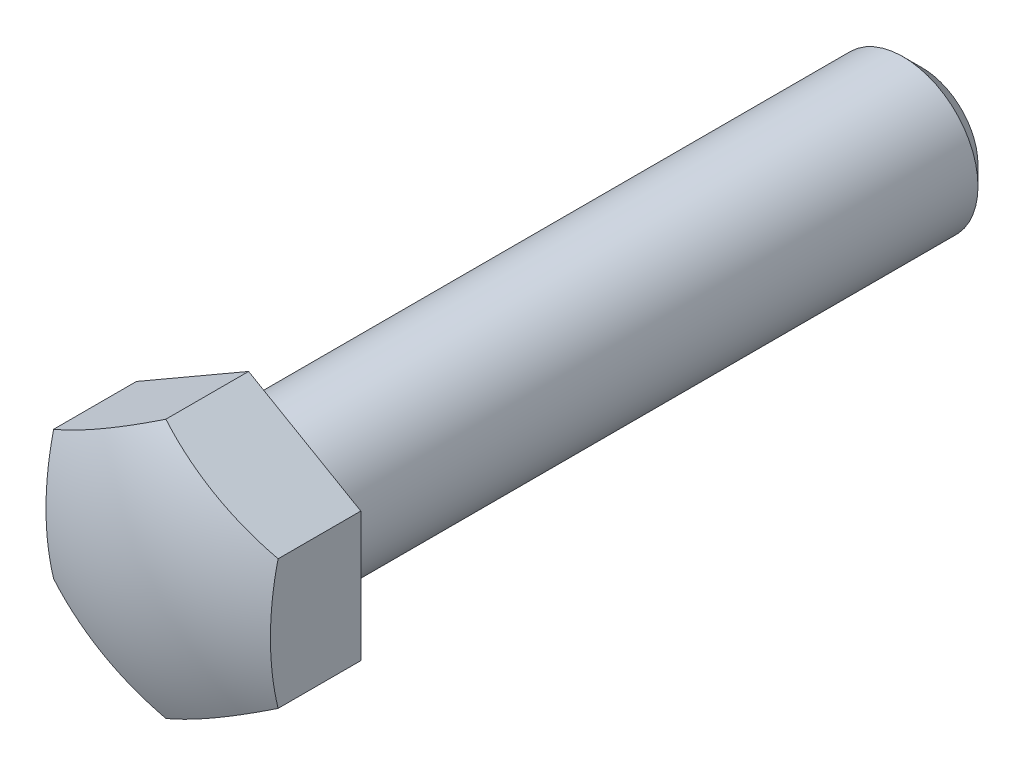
ISO-10303-21;
HEADER;
FILE_DESCRIPTION(('STEP AP214'),'2;1');
FILE_NAME('part.step','',(''),(''),'','','');
FILE_SCHEMA(('AUTOMOTIVE_DESIGN { 1 0 10303 214 1 1 1 1 }'));
ENDSEC;
DATA;
#1=APPLICATION_CONTEXT('core data for automotive mechanical design processes');
#2=APPLICATION_PROTOCOL_DEFINITION('international standard','automotive_design',2000,#1);
#3=PRODUCT_CONTEXT('',#1,'mechanical');
#4=PRODUCT('Part','Part','',(#3));
#5=PRODUCT_RELATED_PRODUCT_CATEGORY('part','',(#4));
#6=PRODUCT_DEFINITION_FORMATION('','',#4);
#7=PRODUCT_DEFINITION_CONTEXT('part definition',#1,'design');
#8=PRODUCT_DEFINITION('design','',#6,#7);
#9=PRODUCT_DEFINITION_SHAPE('','',#8);
#10=(LENGTH_UNIT() NAMED_UNIT(*) SI_UNIT(.MILLI.,.METRE.));
#11=(NAMED_UNIT(*) PLANE_ANGLE_UNIT() SI_UNIT($,.RADIAN.));
#12=(NAMED_UNIT(*) SI_UNIT($,.STERADIAN.) SOLID_ANGLE_UNIT());
#13=UNCERTAINTY_MEASURE_WITH_UNIT(LENGTH_MEASURE(1.E-05),#10,'distance_accuracy_value','');
#14=(GEOMETRIC_REPRESENTATION_CONTEXT(3) GLOBAL_UNCERTAINTY_ASSIGNED_CONTEXT((#13)) GLOBAL_UNIT_ASSIGNED_CONTEXT((#10,
#11,#12)) REPRESENTATION_CONTEXT('',''));
#15=CARTESIAN_POINT('',(0.,0.,0.));
#16=DIRECTION('',(0.,0.,1.));
#17=DIRECTION('',(1.,0.,0.));
#18=AXIS2_PLACEMENT_3D('',#15,#16,#17);
#19=CARTESIAN_POINT('',(10.,0.,0.));
#20=DIRECTION('',(0.,0.,1.));
#21=DIRECTION('',(1.,0.,0.));
#22=AXIS2_PLACEMENT_3D('',#19,#20,#21);
#23=PLANE('',#22);
#24=CARTESIAN_POINT('',(0.,0.,0.));
#25=DIRECTION('',(0.,0.,1.));
#26=DIRECTION('',(1.,0.,0.));
#27=AXIS2_PLACEMENT_3D('',#24,#25,#26);
#28=CIRCLE('',#27,10.);
#29=CARTESIAN_POINT('',(10.,0.,0.));
#30=VERTEX_POINT('',#29);
#31=EDGE_CURVE('E115',#30,#30,#28,.T.);
#32=ORIENTED_EDGE('',*,*,#31,.T.);
#33=EDGE_LOOP('',(#32));
#34=FACE_BOUND('',#33,.T.);
#35=DIRECTION('',(-0.86602540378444,-0.5,0.));
#36=VECTOR('',#35,1.);
#37=CARTESIAN_POINT('',(15.,-8.66025403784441,0.));
#38=LINE('',#37,#36);
#39=CARTESIAN_POINT('',(15.,-8.66025403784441,0.));
#40=VERTEX_POINT('',#39);
#41=CARTESIAN_POINT('',(0.,-17.3205080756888,0.));
#42=VERTEX_POINT('',#41);
#43=EDGE_CURVE('E89',#40,#42,#38,.T.);
#44=ORIENTED_EDGE('',*,*,#43,.T.);
#45=DIRECTION('',(0.86602540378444,-0.5,0.));
#46=VECTOR('',#45,1.);
#47=CARTESIAN_POINT('',(-15.,-8.66025403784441,0.));
#48=LINE('',#47,#46);
#49=CARTESIAN_POINT('',(-15.,-8.6602540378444,0.));
#50=VERTEX_POINT('',#49);
#51=EDGE_CURVE('E87',#50,#42,#48,.T.);
#52=ORIENTED_EDGE('',*,*,#51,.F.);
#53=DIRECTION('',(0.,-1.,0.));
#54=VECTOR('',#53,1.);
#55=CARTESIAN_POINT('',(-15.,8.66025403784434,0.));
#56=LINE('',#55,#54);
#57=CARTESIAN_POINT('',(-15.,8.66025403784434,0.));
#58=VERTEX_POINT('',#57);
#59=EDGE_CURVE('E37',#58,#50,#56,.T.);
#60=ORIENTED_EDGE('',*,*,#59,.F.);
#61=DIRECTION('',(0.866025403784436,0.5,0.));
#62=VECTOR('',#61,1.);
#63=CARTESIAN_POINT('',(-15.,8.66025403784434,0.));
#64=LINE('',#63,#62);
#65=CARTESIAN_POINT('',(0.,17.3205080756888,0.));
#66=VERTEX_POINT('',#65);
#67=EDGE_CURVE('E77',#58,#66,#64,.T.);
#68=ORIENTED_EDGE('',*,*,#67,.T.);
#69=DIRECTION('',(-0.866025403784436,0.5,0.));
#70=VECTOR('',#69,1.);
#71=CARTESIAN_POINT('',(15.,8.66025403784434,0.));
#72=LINE('',#71,#70);
#73=CARTESIAN_POINT('',(15.,8.66025403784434,0.));
#74=VERTEX_POINT('',#73);
#75=EDGE_CURVE('E83',#74,#66,#72,.T.);
#76=ORIENTED_EDGE('',*,*,#75,.F.);
#77=DIRECTION('',(0.,-1.,0.));
#78=VECTOR('',#77,1.);
#79=CARTESIAN_POINT('',(15.,8.66025403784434,0.));
#80=LINE('',#79,#78);
#81=EDGE_CURVE('E95',#74,#40,#80,.T.);
#82=ORIENTED_EDGE('',*,*,#81,.T.);
#83=EDGE_LOOP('',(#44,#52,#60,#68,#76,#82));
#84=FACE_BOUND('',#83,.T.);
#85=ADVANCED_FACE('F14',(#34,#84),#23,.F.);
#86=CARTESIAN_POINT('',(0.,0.,-30.));
#87=DIRECTION('',(0.,0.,1.));
#88=DIRECTION('',(1.,0.,0.));
#89=AXIS2_PLACEMENT_3D('',#86,#87,#88);
#90=CYLINDRICAL_SURFACE('',#89,10.);
#91=CARTESIAN_POINT('',(0.,0.,-87.5));
#92=DIRECTION('',(0.,0.,1.));
#93=DIRECTION('',(1.,0.,0.));
#94=AXIS2_PLACEMENT_3D('',#91,#92,#93);
#95=CIRCLE('',#94,10.);
#96=CARTESIAN_POINT('',(10.,0.,-87.5));
#97=VERTEX_POINT('',#96);
#98=EDGE_CURVE('E22',#97,#97,#95,.T.);
#99=ORIENTED_EDGE('',*,*,#98,.T.);
#100=EDGE_LOOP('',(#99));
#101=FACE_BOUND('',#100,.T.);
#102=ORIENTED_EDGE('',*,*,#31,.F.);
#103=EDGE_LOOP('',(#102));
#104=FACE_BOUND('',#103,.T.);
#105=ADVANCED_FACE('F120',(#101,#104),#90,.T.);
#106=CARTESIAN_POINT('',(0.,0.,-90.));
#107=DIRECTION('',(0.,0.,1.));
#108=DIRECTION('',(1.,0.,0.));
#109=AXIS2_PLACEMENT_3D('',#106,#107,#108);
#110=PLANE('',#109);
#111=CARTESIAN_POINT('',(0.,0.,-90.));
#112=DIRECTION('',(0.,0.,1.));
#113=DIRECTION('',(1.,0.,0.));
#114=AXIS2_PLACEMENT_3D('',#111,#112,#113);
#115=CIRCLE('',#114,7.5);
#116=CARTESIAN_POINT('',(7.5,0.,-90.));
#117=VERTEX_POINT('',#116);
#118=EDGE_CURVE('E9',#117,#117,#115,.F.);
#119=ORIENTED_EDGE('',*,*,#118,.T.);
#120=EDGE_LOOP('',(#119));
#121=FACE_BOUND('',#120,.T.);
#122=ADVANCED_FACE('F141',(#121),#110,.F.);
#123=CARTESIAN_POINT('',(15.,-8.66025403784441,15.));
#124=DIRECTION('',(0.5,-0.86602540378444,0.));
#125=DIRECTION('',(0.86602540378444,0.5,0.));
#126=AXIS2_PLACEMENT_3D('',#123,#124,#125);
#127=PLANE('',#126);
#128=DIRECTION('',(0.,0.,-1.));
#129=VECTOR('',#128,1.);
#130=CARTESIAN_POINT('',(0.,-17.3205080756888,15.));
#131=LINE('',#130,#129);
#132=CARTESIAN_POINT('',(0.,-17.3205080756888,11.05551275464));
#133=VERTEX_POINT('',#132);
#134=EDGE_CURVE('E29',#133,#42,#131,.T.);
#135=ORIENTED_EDGE('',*,*,#134,.T.);
#136=ORIENTED_EDGE('',*,*,#43,.F.);
#137=DIRECTION('',(0.,0.,-1.));
#138=VECTOR('',#137,1.);
#139=CARTESIAN_POINT('',(15.,-8.66025403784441,15.));
#140=LINE('',#139,#138);
#141=CARTESIAN_POINT('',(15.,-8.66025403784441,11.05551275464));
#142=VERTEX_POINT('',#141);
#143=EDGE_CURVE('E100',#142,#40,#140,.T.);
#144=ORIENTED_EDGE('',*,*,#143,.F.);
#145=CARTESIAN_POINT('',(7.5,-12.9903810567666,-25.));
#146=DIRECTION('',(0.5,-0.86602540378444,0.));
#147=DIRECTION('',(0.86602540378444,0.5,0.));
#148=AXIS2_PLACEMENT_3D('',#145,#146,#147);
#149=CIRCLE('',#148,37.0809924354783);
#150=EDGE_CURVE('E112',#133,#142,#149,.F.);
#151=ORIENTED_EDGE('',*,*,#150,.F.);
#152=EDGE_LOOP('',(#135,#136,#144,#151));
#153=FACE_BOUND('',#152,.T.);
#154=ADVANCED_FACE('F146',(#153),#127,.T.);
#155=CARTESIAN_POINT('',(15.,8.66025403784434,15.));
#156=DIRECTION('',(1.,0.,0.));
#157=DIRECTION('',(0.,1.,0.));
#158=AXIS2_PLACEMENT_3D('',#155,#156,#157);
#159=PLANE('',#158);
#160=ORIENTED_EDGE('',*,*,#143,.T.);
#161=ORIENTED_EDGE('',*,*,#81,.F.);
#162=DIRECTION('',(0.,0.,-1.));
#163=VECTOR('',#162,1.);
#164=CARTESIAN_POINT('',(15.,8.66025403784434,15.));
#165=LINE('',#164,#163);
#166=CARTESIAN_POINT('',(15.,8.66025403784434,11.05551275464));
#167=VERTEX_POINT('',#166);
#168=EDGE_CURVE('E98',#167,#74,#165,.T.);
#169=ORIENTED_EDGE('',*,*,#168,.F.);
#170=CARTESIAN_POINT('',(15.,0.,-25.));
#171=DIRECTION('',(1.,0.,0.));
#172=DIRECTION('',(0.,1.,0.));
#173=AXIS2_PLACEMENT_3D('',#170,#171,#172);
#174=CIRCLE('',#173,37.0809924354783);
#175=EDGE_CURVE('E109',#142,#167,#174,.F.);
#176=ORIENTED_EDGE('',*,*,#175,.F.);
#177=EDGE_LOOP('',(#160,#161,#169,#176));
#178=FACE_BOUND('',#177,.T.);
#179=ADVANCED_FACE('F148',(#178),#159,.T.);
#180=CARTESIAN_POINT('',(15.,8.66025403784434,15.));
#181=DIRECTION('',(-0.5,-0.866025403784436,0.));
#182=DIRECTION('',(0.866025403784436,-0.5,0.));
#183=AXIS2_PLACEMENT_3D('',#180,#181,#182);
#184=PLANE('',#183);
#185=CARTESIAN_POINT('',(7.5,12.9903810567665,-25.));
#186=DIRECTION('',(-0.5,-0.866025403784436,0.));
#187=DIRECTION('',(0.866025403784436,-0.5,0.));
#188=AXIS2_PLACEMENT_3D('',#185,#186,#187);
#189=CIRCLE('',#188,37.0809924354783);
#190=CARTESIAN_POINT('',(0.,17.3205080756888,11.05551275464));
#191=VERTEX_POINT('',#190);
#192=EDGE_CURVE('E107',#191,#167,#189,.F.);
#193=ORIENTED_EDGE('',*,*,#192,.T.);
#194=ORIENTED_EDGE('',*,*,#168,.T.);
#195=ORIENTED_EDGE('',*,*,#75,.T.);
#196=DIRECTION('',(0.,0.,-1.));
#197=VECTOR('',#196,1.);
#198=CARTESIAN_POINT('',(0.,17.3205080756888,15.));
#199=LINE('',#198,#197);
#200=EDGE_CURVE('E73',#191,#66,#199,.T.);
#201=ORIENTED_EDGE('',*,*,#200,.F.);
#202=EDGE_LOOP('',(#193,#194,#195,#201));
#203=FACE_BOUND('',#202,.T.);
#204=ADVANCED_FACE('F151',(#203),#184,.F.);
#205=CARTESIAN_POINT('',(-15.,8.66025403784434,15.));
#206=DIRECTION('',(-0.5,0.866025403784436,0.));
#207=DIRECTION('',(-0.866025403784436,-0.5,0.));
#208=AXIS2_PLACEMENT_3D('',#205,#206,#207);
#209=PLANE('',#208);
#210=ORIENTED_EDGE('',*,*,#200,.T.);
#211=ORIENTED_EDGE('',*,*,#67,.F.);
#212=DIRECTION('',(0.,0.,-1.));
#213=VECTOR('',#212,1.);
#214=CARTESIAN_POINT('',(-15.,8.66025403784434,15.));
#215=LINE('',#214,#213);
#216=CARTESIAN_POINT('',(-15.,8.66025403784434,11.05551275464));
#217=VERTEX_POINT('',#216);
#218=EDGE_CURVE('E66',#217,#58,#215,.T.);
#219=ORIENTED_EDGE('',*,*,#218,.F.);
#220=CARTESIAN_POINT('',(-7.5,12.9903810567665,-25.));
#221=DIRECTION('',(-0.5,0.866025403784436,0.));
#222=DIRECTION('',(-0.866025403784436,-0.5,0.));
#223=AXIS2_PLACEMENT_3D('',#220,#221,#222);
#224=CIRCLE('',#223,37.0809924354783);
#225=EDGE_CURVE('E105',#191,#217,#224,.F.);
#226=ORIENTED_EDGE('',*,*,#225,.F.);
#227=EDGE_LOOP('',(#210,#211,#219,#226));
#228=FACE_BOUND('',#227,.T.);
#229=ADVANCED_FACE('F78',(#228),#209,.T.);
#230=CARTESIAN_POINT('',(-15.,8.66025403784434,15.));
#231=DIRECTION('',(1.,0.,0.));
#232=DIRECTION('',(0.,1.,0.));
#233=AXIS2_PLACEMENT_3D('',#230,#231,#232);
#234=PLANE('',#233);
#235=CARTESIAN_POINT('',(-15.,0.,-25.));
#236=DIRECTION('',(1.,0.,0.));
#237=DIRECTION('',(0.,1.,0.));
#238=AXIS2_PLACEMENT_3D('',#235,#236,#237);
#239=CIRCLE('',#238,37.0809924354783);
#240=CARTESIAN_POINT('',(-15.,-8.66025403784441,11.05551275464));
#241=VERTEX_POINT('',#240);
#242=EDGE_CURVE('E70',#241,#217,#239,.F.);
#243=ORIENTED_EDGE('',*,*,#242,.T.);
#244=ORIENTED_EDGE('',*,*,#218,.T.);
#245=ORIENTED_EDGE('',*,*,#59,.T.);
#246=DIRECTION('',(0.,0.,-1.));
#247=VECTOR('',#246,1.);
#248=CARTESIAN_POINT('',(-15.,-8.66025403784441,15.));
#249=LINE('',#248,#247);
#250=EDGE_CURVE('E74',#241,#50,#249,.T.);
#251=ORIENTED_EDGE('',*,*,#250,.F.);
#252=EDGE_LOOP('',(#243,#244,#245,#251));
#253=FACE_BOUND('',#252,.T.);
#254=ADVANCED_FACE('F68',(#253),#234,.F.);
#255=CARTESIAN_POINT('',(-15.,-8.66025403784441,15.));
#256=DIRECTION('',(0.5,0.86602540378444,0.));
#257=DIRECTION('',(-0.86602540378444,0.5,0.));
#258=AXIS2_PLACEMENT_3D('',#255,#256,#257);
#259=PLANE('',#258);
#260=CARTESIAN_POINT('',(-7.5,-12.9903810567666,-25.));
#261=DIRECTION('',(0.5,0.86602540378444,0.));
#262=DIRECTION('',(-0.86602540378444,0.5,0.));
#263=AXIS2_PLACEMENT_3D('',#260,#261,#262);
#264=CIRCLE('',#263,37.0809924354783);
#265=EDGE_CURVE('E102',#133,#241,#264,.F.);
#266=ORIENTED_EDGE('',*,*,#265,.T.);
#267=ORIENTED_EDGE('',*,*,#250,.T.);
#268=ORIENTED_EDGE('',*,*,#51,.T.);
#269=ORIENTED_EDGE('',*,*,#134,.F.);
#270=EDGE_LOOP('',(#266,#267,#268,#269));
#271=FACE_BOUND('',#270,.T.);
#272=ADVANCED_FACE('F131',(#271),#259,.F.);
#273=CARTESIAN_POINT('',(0.,0.,-25.));
#274=DIRECTION('',(0.,0.,1.));
#275=DIRECTION('',(1.,0.,0.));
#276=AXIS2_PLACEMENT_3D('',#273,#274,#275);
#277=SPHERICAL_SURFACE('',#276,40.);
#278=ORIENTED_EDGE('',*,*,#265,.F.);
#279=ORIENTED_EDGE('',*,*,#150,.T.);
#280=ORIENTED_EDGE('',*,*,#175,.T.);
#281=ORIENTED_EDGE('',*,*,#192,.F.);
#282=ORIENTED_EDGE('',*,*,#225,.T.);
#283=ORIENTED_EDGE('',*,*,#242,.F.);
#284=EDGE_LOOP('',(#278,#279,#280,#281,#282,#283));
#285=FACE_BOUND('',#284,.T.);
#286=ADVANCED_FACE('F124',(#285),#277,.T.);
#287=CARTESIAN_POINT('',(0.,0.,-87.5));
#288=DIRECTION('',(0.,0.,1.));
#289=DIRECTION('',(1.,0.,0.));
#290=AXIS2_PLACEMENT_3D('',#287,#288,#289);
#291=CONICAL_SURFACE('',#290,10.,0.785398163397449);
#292=ORIENTED_EDGE('',*,*,#118,.F.);
#293=EDGE_LOOP('',(#292));
#294=FACE_BOUND('',#293,.T.);
#295=ORIENTED_EDGE('',*,*,#98,.F.);
#296=EDGE_LOOP('',(#295));
#297=FACE_BOUND('',#296,.T.);
#298=ADVANCED_FACE('F16',(#294,#297),#291,.T.);
#299=CLOSED_SHELL('',(#85,#105,#122,#154,#179,#204,#229,#254,#272,#286,#298));
#300=MANIFOLD_SOLID_BREP('B1',#299);
#301=ADVANCED_BREP_SHAPE_REPRESENTATION('',(#18,#300),#14);
#302=SHAPE_DEFINITION_REPRESENTATION(#9,#301);
ENDSEC;
END-ISO-10303-21;
